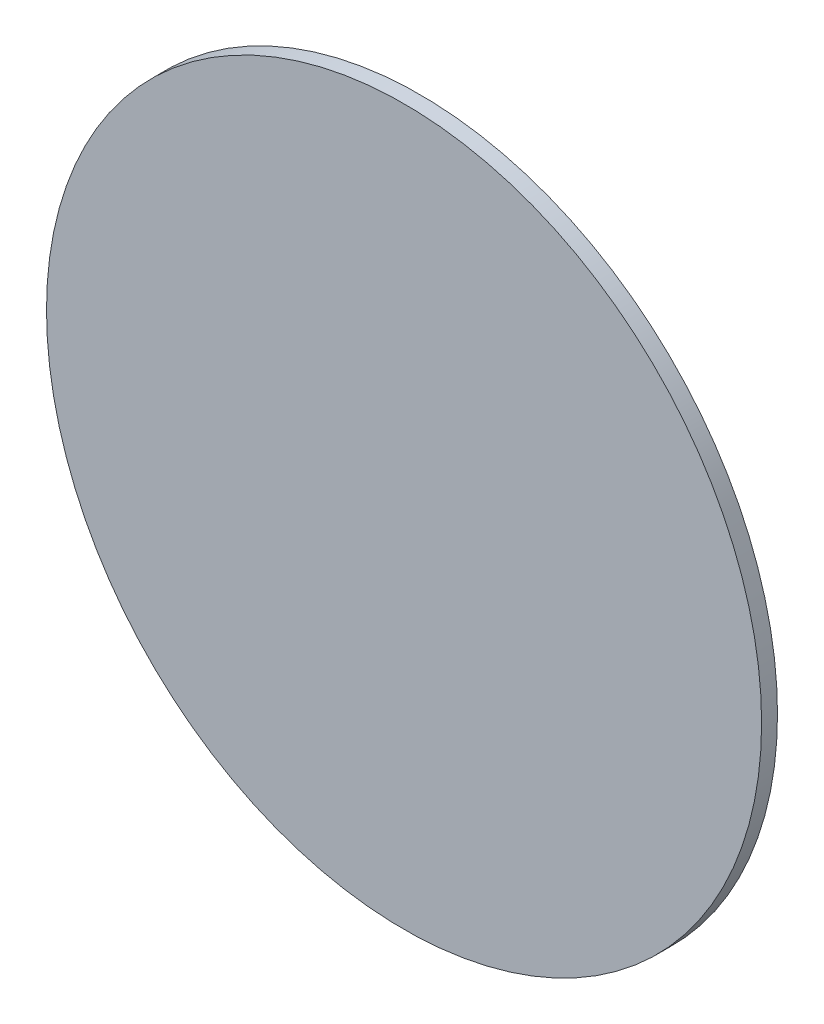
ISO-10303-21;
HEADER;
FILE_DESCRIPTION(('STEP AP214'),'2;1');
FILE_NAME('part.step','',(''),(''),'','','');
FILE_SCHEMA(('AUTOMOTIVE_DESIGN { 1 0 10303 214 1 1 1 1 }'));
ENDSEC;
DATA;
#1=APPLICATION_CONTEXT('core data for automotive mechanical design processes');
#2=APPLICATION_PROTOCOL_DEFINITION('international standard','automotive_design',2000,#1);
#3=PRODUCT_CONTEXT('',#1,'mechanical');
#4=PRODUCT('Part','Part','',(#3));
#5=PRODUCT_RELATED_PRODUCT_CATEGORY('part','',(#4));
#6=PRODUCT_DEFINITION_FORMATION('','',#4);
#7=PRODUCT_DEFINITION_CONTEXT('part definition',#1,'design');
#8=PRODUCT_DEFINITION('design','',#6,#7);
#9=PRODUCT_DEFINITION_SHAPE('','',#8);
#10=(LENGTH_UNIT() NAMED_UNIT(*) SI_UNIT(.MILLI.,.METRE.));
#11=(NAMED_UNIT(*) PLANE_ANGLE_UNIT() SI_UNIT($,.RADIAN.));
#12=(NAMED_UNIT(*) SI_UNIT($,.STERADIAN.) SOLID_ANGLE_UNIT());
#13=UNCERTAINTY_MEASURE_WITH_UNIT(LENGTH_MEASURE(1.E-05),#10,'distance_accuracy_value','');
#14=(GEOMETRIC_REPRESENTATION_CONTEXT(3) GLOBAL_UNCERTAINTY_ASSIGNED_CONTEXT((#13)) GLOBAL_UNIT_ASSIGNED_CONTEXT((#10,
#11,#12)) REPRESENTATION_CONTEXT('',''));
#15=CARTESIAN_POINT('',(0.,0.,0.));
#16=DIRECTION('',(0.,0.,1.));
#17=DIRECTION('',(1.,0.,0.));
#18=AXIS2_PLACEMENT_3D('',#15,#16,#17);
#19=CARTESIAN_POINT('',(0.,0.,1.));
#20=DIRECTION('',(0.,0.,-1.));
#21=DIRECTION('',(-1.,0.,0.));
#22=AXIS2_PLACEMENT_3D('',#19,#20,#21);
#23=CYLINDRICAL_SURFACE('',#22,22.5);
#24=CARTESIAN_POINT('',(0.,0.,1.));
#25=DIRECTION('',(0.,0.,1.));
#26=DIRECTION('',(1.,0.,0.));
#27=AXIS2_PLACEMENT_3D('',#24,#25,#26);
#28=CIRCLE('',#27,22.5);
#29=CARTESIAN_POINT('',(22.5,0.,1.));
#30=VERTEX_POINT('',#29);
#31=EDGE_CURVE('E10',#30,#30,#28,.T.);
#32=ORIENTED_EDGE('',*,*,#31,.F.);
#33=EDGE_LOOP('',(#32));
#34=FACE_BOUND('',#33,.T.);
#35=CARTESIAN_POINT('',(0.,0.,0.));
#36=DIRECTION('',(0.,0.,1.));
#37=DIRECTION('',(1.,0.,0.));
#38=AXIS2_PLACEMENT_3D('',#35,#36,#37);
#39=CIRCLE('',#38,22.5);
#40=CARTESIAN_POINT('',(22.5,0.,0.));
#41=VERTEX_POINT('',#40);
#42=EDGE_CURVE('E34',#41,#41,#39,.T.);
#43=ORIENTED_EDGE('',*,*,#42,.T.);
#44=EDGE_LOOP('',(#43));
#45=FACE_BOUND('',#44,.T.);
#46=ADVANCED_FACE('F31',(#34,#45),#23,.T.);
#47=CARTESIAN_POINT('',(0.,0.,1.));
#48=DIRECTION('',(0.,0.,1.));
#49=DIRECTION('',(1.,0.,0.));
#50=AXIS2_PLACEMENT_3D('',#47,#48,#49);
#51=PLANE('',#50);
#52=ORIENTED_EDGE('',*,*,#31,.T.);
#53=EDGE_LOOP('',(#52));
#54=FACE_BOUND('',#53,.T.);
#55=ADVANCED_FACE('F46',(#54),#51,.T.);
#56=CARTESIAN_POINT('',(0.,0.,0.));
#57=DIRECTION('',(0.,0.,1.));
#58=DIRECTION('',(1.,0.,0.));
#59=AXIS2_PLACEMENT_3D('',#56,#57,#58);
#60=PLANE('',#59);
#61=ORIENTED_EDGE('',*,*,#42,.F.);
#62=EDGE_LOOP('',(#61));
#63=FACE_BOUND('',#62,.T.);
#64=ADVANCED_FACE('F44',(#63),#60,.F.);
#65=CLOSED_SHELL('',(#46,#55,#64));
#66=MANIFOLD_SOLID_BREP('B2',#65);
#67=ADVANCED_BREP_SHAPE_REPRESENTATION('',(#18,#66),#14);
#68=SHAPE_DEFINITION_REPRESENTATION(#9,#67);
ENDSEC;
END-ISO-10303-21;
